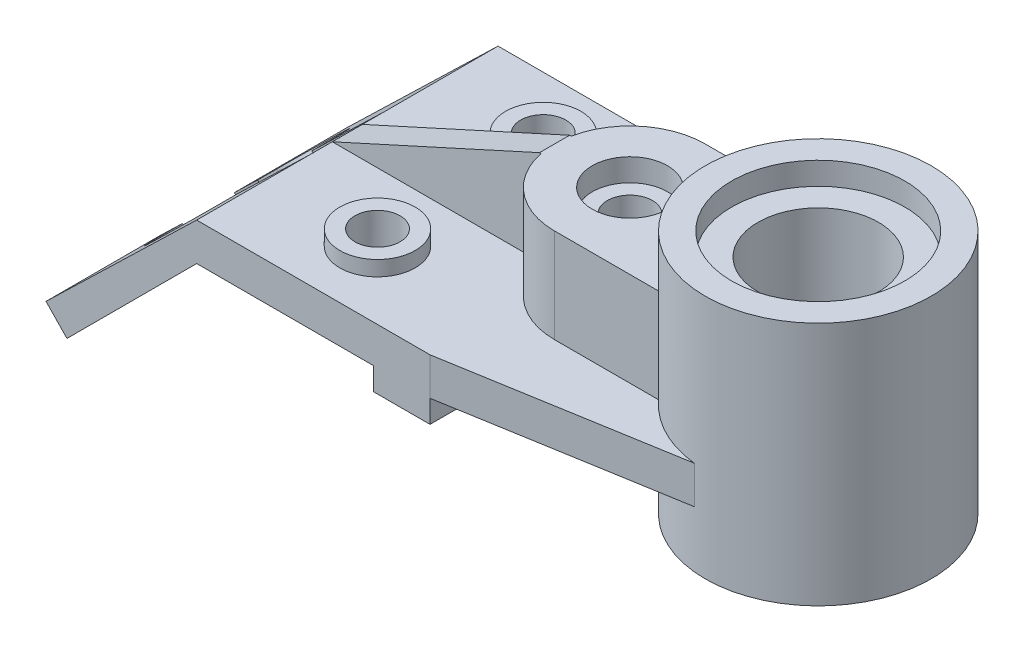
ISO-10303-21;
HEADER;
FILE_DESCRIPTION(('STEP AP214'),'2;1');
FILE_NAME('part.step','',(''),(''),'','','');
FILE_SCHEMA(('AUTOMOTIVE_DESIGN { 1 0 10303 214 1 1 1 1 }'));
ENDSEC;
DATA;
#1=APPLICATION_CONTEXT('core data for automotive mechanical design processes');
#2=APPLICATION_PROTOCOL_DEFINITION('international standard','automotive_design',2000,#1);
#3=PRODUCT_CONTEXT('',#1,'mechanical');
#4=PRODUCT('Part','Part','',(#3));
#5=PRODUCT_RELATED_PRODUCT_CATEGORY('part','',(#4));
#6=PRODUCT_DEFINITION_FORMATION('','',#4);
#7=PRODUCT_DEFINITION_CONTEXT('part definition',#1,'design');
#8=PRODUCT_DEFINITION('design','',#6,#7);
#9=PRODUCT_DEFINITION_SHAPE('','',#8);
#10=(LENGTH_UNIT() NAMED_UNIT(*) SI_UNIT(.MILLI.,.METRE.));
#11=(NAMED_UNIT(*) PLANE_ANGLE_UNIT() SI_UNIT($,.RADIAN.));
#12=(NAMED_UNIT(*) SI_UNIT($,.STERADIAN.) SOLID_ANGLE_UNIT());
#13=UNCERTAINTY_MEASURE_WITH_UNIT(LENGTH_MEASURE(1.E-05),#10,'distance_accuracy_value','');
#14=(GEOMETRIC_REPRESENTATION_CONTEXT(3) GLOBAL_UNCERTAINTY_ASSIGNED_CONTEXT((#13)) GLOBAL_UNIT_ASSIGNED_CONTEXT((#10,
#11,#12)) REPRESENTATION_CONTEXT('',''));
#15=CARTESIAN_POINT('',(0.,0.,0.));
#16=DIRECTION('',(0.,0.,1.));
#17=DIRECTION('',(1.,0.,0.));
#18=AXIS2_PLACEMENT_3D('',#15,#16,#17);
#19=CARTESIAN_POINT('',(-8.51996401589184,15.,-5.29140855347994));
#20=DIRECTION('',(0.,-1.,0.));
#21=DIRECTION('',(0.,0.,-1.));
#22=AXIS2_PLACEMENT_3D('',#19,#20,#21);
#23=PLANE('',#22);
#24=DIRECTION('',(0.,0.,1.));
#25=VECTOR('',#24,1.);
#26=CARTESIAN_POINT('',(-71.5732580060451,15.,-45.2914085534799));
#27=LINE('',#26,#25);
#28=CARTESIAN_POINT('',(-71.5732580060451,15.,-45.2914085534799));
#29=VERTEX_POINT('',#28);
#30=CARTESIAN_POINT('',(-71.5732580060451,15.,34.7085914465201));
#31=VERTEX_POINT('',#30);
#32=EDGE_CURVE('E432',#29,#31,#27,.T.);
#33=ORIENTED_EDGE('',*,*,#32,.F.);
#34=DIRECTION('',(-0.98597565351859,0.,-0.166889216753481));
#35=VECTOR('',#34,1.);
#36=CARTESIAN_POINT('',(-11.5732580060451,15.,-35.1356273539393));
#37=LINE('',#36,#35);
#38=CARTESIAN_POINT('',(-11.5732580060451,15.,-35.1356273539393));
#39=VERTEX_POINT('',#38);
#40=EDGE_CURVE('E280',#39,#29,#37,.T.);
#41=ORIENTED_EDGE('',*,*,#40,.F.);
#42=CARTESIAN_POINT('',(-8.51996401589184,15.,-5.29140855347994));
#43=DIRECTION('',(0.,-1.,0.));
#44=DIRECTION('',(0.,0.,-1.));
#45=AXIS2_PLACEMENT_3D('',#42,#43,#44);
#46=CIRCLE('',#45,30.);
#47=CARTESIAN_POINT('',(-11.5732580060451,15.,24.5528102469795));
#48=VERTEX_POINT('',#47);
#49=EDGE_CURVE('E288',#48,#39,#46,.T.);
#50=ORIENTED_EDGE('',*,*,#49,.F.);
#51=DIRECTION('',(0.985975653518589,0.,-0.166889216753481));
#52=VECTOR('',#51,1.);
#53=CARTESIAN_POINT('',(-71.5732580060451,15.,34.7085914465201));
#54=LINE('',#53,#52);
#55=EDGE_CURVE('E294',#31,#48,#54,.T.);
#56=ORIENTED_EDGE('',*,*,#55,.F.);
#57=EDGE_LOOP('',(#33,#41,#50,#56));
#58=FACE_BOUND('',#57,.T.);
#59=CARTESIAN_POINT('',(-58.5199640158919,15.,-5.29140855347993));
#60=DIRECTION('',(0.,-1.,0.));
#61=DIRECTION('',(0.,0.,-1.));
#62=AXIS2_PLACEMENT_3D('',#59,#60,#61);
#63=CIRCLE('',#62,6.);
#64=CARTESIAN_POINT('',(-58.5199640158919,15.,-11.2914085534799));
#65=VERTEX_POINT('',#64);
#66=EDGE_CURVE('E341',#65,#65,#63,.T.);
#67=ORIENTED_EDGE('',*,*,#66,.F.);
#68=EDGE_LOOP('',(#67));
#69=FACE_BOUND('',#68,.T.);
#70=ADVANCED_FACE('F43',(#58,#69),#23,.T.);
#71=CARTESIAN_POINT('',(-8.51996401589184,25.,-5.29140855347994));
#72=DIRECTION('',(0.,-1.,0.));
#73=DIRECTION('',(0.,0.,-1.));
#74=AXIS2_PLACEMENT_3D('',#71,#72,#73);
#75=PLANE('',#74);
#76=CARTESIAN_POINT('',(-103.519964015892,25.,-27.2914085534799));
#77=DIRECTION('',(0.,-1.,0.));
#78=DIRECTION('',(0.,0.,-1.));
#79=AXIS2_PLACEMENT_3D('',#76,#77,#78);
#80=CIRCLE('',#79,9.99999999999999);
#81=CARTESIAN_POINT('',(-103.519964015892,25.,-37.2914085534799));
#82=VERTEX_POINT('',#81);
#83=EDGE_CURVE('E340',#82,#82,#80,.F.);
#84=ORIENTED_EDGE('',*,*,#83,.F.);
#85=EDGE_LOOP('',(#84));
#86=FACE_BOUND('',#85,.T.);
#87=DIRECTION('',(1.,0.,0.));
#88=VECTOR('',#87,1.);
#89=CARTESIAN_POINT('',(-68.5199640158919,25.,-9.29140855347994));
#90=LINE('',#89,#88);
#91=CARTESIAN_POINT('',(-133.519964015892,25.,-9.29140855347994));
#92=VERTEX_POINT('',#91);
#93=CARTESIAN_POINT('',(-78.1158819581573,25.,-9.29140855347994));
#94=VERTEX_POINT('',#93);
#95=EDGE_CURVE('E355',#92,#94,#90,.T.);
#96=ORIENTED_EDGE('',*,*,#95,.T.);
#97=CARTESIAN_POINT('',(-58.5199640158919,25.,-5.29140855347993));
#98=DIRECTION('',(0.,1.,0.));
#99=DIRECTION('',(0.,0.,1.));
#100=AXIS2_PLACEMENT_3D('',#97,#98,#99);
#101=CIRCLE('',#100,20.);
#102=CARTESIAN_POINT('',(-58.5199640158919,25.,-25.2914085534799));
#103=VERTEX_POINT('',#102);
#104=EDGE_CURVE('E598',#103,#94,#101,.T.);
#105=ORIENTED_EDGE('',*,*,#104,.F.);
#106=DIRECTION('',(-1.,0.,0.));
#107=VECTOR('',#106,1.);
#108=CARTESIAN_POINT('',(-58.5199640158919,25.,-25.2914085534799));
#109=LINE('',#108,#107);
#110=CARTESIAN_POINT('',(-30.8806437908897,25.,-25.2914085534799));
#111=VERTEX_POINT('',#110);
#112=EDGE_CURVE('E606',#111,#103,#109,.T.);
#113=ORIENTED_EDGE('',*,*,#112,.F.);
#114=CARTESIAN_POINT('',(-8.51996401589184,25.,-5.29140855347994));
#115=DIRECTION('',(0.,-1.,0.));
#116=DIRECTION('',(0.,0.,-1.));
#117=AXIS2_PLACEMENT_3D('',#114,#115,#116);
#118=CIRCLE('',#117,30.);
#119=CARTESIAN_POINT('',(-11.5732580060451,25.,-35.1356273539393));
#120=VERTEX_POINT('',#119);
#121=EDGE_CURVE('E297',#111,#120,#118,.T.);
#122=ORIENTED_EDGE('',*,*,#121,.T.);
#123=DIRECTION('',(-0.98597565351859,0.,-0.166889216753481));
#124=VECTOR('',#123,1.);
#125=CARTESIAN_POINT('',(-11.5732580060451,25.,-35.1356273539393));
#126=LINE('',#125,#124);
#127=CARTESIAN_POINT('',(-71.5732580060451,25.,-45.2914085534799));
#128=VERTEX_POINT('',#127);
#129=EDGE_CURVE('E627',#120,#128,#126,.T.);
#130=ORIENTED_EDGE('',*,*,#129,.T.);
#131=DIRECTION('',(-1.,0.,0.));
#132=VECTOR('',#131,1.);
#133=CARTESIAN_POINT('',(-71.5732580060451,25.,-45.2914085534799));
#134=LINE('',#133,#132);
#135=CARTESIAN_POINT('',(-133.519964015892,25.,-45.2914085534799));
#136=VERTEX_POINT('',#135);
#137=EDGE_CURVE('E387',#128,#136,#134,.T.);
#138=ORIENTED_EDGE('',*,*,#137,.T.);
#139=DIRECTION('',(0.,0.,1.));
#140=VECTOR('',#139,1.);
#141=CARTESIAN_POINT('',(-133.519964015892,25.,-45.2914085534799));
#142=LINE('',#141,#140);
#143=EDGE_CURVE('E376',#136,#92,#142,.T.);
#144=ORIENTED_EDGE('',*,*,#143,.T.);
#145=EDGE_LOOP('',(#96,#105,#113,#122,#130,#138,#144));
#146=FACE_BOUND('',#145,.T.);
#147=ADVANCED_FACE('F637',(#86,#146),#75,.F.);
#148=CARTESIAN_POINT('',(-58.5199640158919,50.,-5.29140855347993));
#149=DIRECTION('',(0.,-1.,0.));
#150=DIRECTION('',(0.,0.,-1.));
#151=AXIS2_PLACEMENT_3D('',#148,#149,#150);
#152=CYLINDRICAL_SURFACE('',#151,20.);
#153=DIRECTION('',(0.,-1.,0.));
#154=VECTOR('',#153,1.);
#155=CARTESIAN_POINT('',(-78.1158819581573,50.,-9.29140855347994));
#156=LINE('',#155,#154);
#157=CARTESIAN_POINT('',(-78.1158819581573,50.,-9.29140855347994));
#158=VERTEX_POINT('',#157);
#159=EDGE_CURVE('E547',#158,#94,#156,.T.);
#160=ORIENTED_EDGE('',*,*,#159,.F.);
#161=CARTESIAN_POINT('',(-58.5199640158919,50.,-5.29140855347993));
#162=DIRECTION('',(0.,1.,0.));
#163=DIRECTION('',(0.,0.,1.));
#164=AXIS2_PLACEMENT_3D('',#161,#162,#163);
#165=CIRCLE('',#164,20.);
#166=CARTESIAN_POINT('',(-58.5199640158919,50.,-25.2914085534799));
#167=VERTEX_POINT('',#166);
#168=EDGE_CURVE('E585',#167,#158,#165,.T.);
#169=ORIENTED_EDGE('',*,*,#168,.F.);
#170=DIRECTION('',(0.,-1.,0.));
#171=VECTOR('',#170,1.);
#172=CARTESIAN_POINT('',(-58.5199640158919,50.,-25.2914085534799));
#173=LINE('',#172,#171);
#174=EDGE_CURVE('E597',#167,#103,#173,.T.);
#175=ORIENTED_EDGE('',*,*,#174,.T.);
#176=ORIENTED_EDGE('',*,*,#104,.T.);
#177=EDGE_LOOP('',(#160,#169,#175,#176));
#178=FACE_BOUND('',#177,.T.);
#179=ADVANCED_FACE('F792',(#178),#152,.T.);
#180=CARTESIAN_POINT('',(-8.51996401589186,65.,-5.29140855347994));
#181=DIRECTION('',(0.,-1.,0.));
#182=DIRECTION('',(0.,0.,-1.));
#183=AXIS2_PLACEMENT_3D('',#180,#181,#182);
#184=CYLINDRICAL_SURFACE('',#183,30.);
#185=CARTESIAN_POINT('',(-8.51996401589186,65.,-5.29140855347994));
#186=DIRECTION('',(0.,1.,0.));
#187=DIRECTION('',(0.,0.,1.));
#188=AXIS2_PLACEMENT_3D('',#185,#186,#187);
#189=CIRCLE('',#188,30.);
#190=CARTESIAN_POINT('',(-8.51996401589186,65.,24.7085914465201));
#191=VERTEX_POINT('',#190);
#192=EDGE_CURVE('E327',#191,#191,#189,.T.);
#193=ORIENTED_EDGE('',*,*,#192,.F.);
#194=EDGE_LOOP('',(#193));
#195=FACE_BOUND('',#194,.T.);
#196=CARTESIAN_POINT('',(-8.51996401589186,0.,-5.29140855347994));
#197=DIRECTION('',(0.,1.,0.));
#198=DIRECTION('',(0.,0.,1.));
#199=AXIS2_PLACEMENT_3D('',#196,#197,#198);
#200=CIRCLE('',#199,30.);
#201=CARTESIAN_POINT('',(-8.51996401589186,0.,24.7085914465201));
#202=VERTEX_POINT('',#201);
#203=EDGE_CURVE('E322',#202,#202,#200,.T.);
#204=ORIENTED_EDGE('',*,*,#203,.T.);
#205=EDGE_LOOP('',(#204));
#206=FACE_BOUND('',#205,.T.);
#207=DIRECTION('',(0.,-1.,0.));
#208=VECTOR('',#207,1.);
#209=CARTESIAN_POINT('',(-30.8806437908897,50.,14.7085914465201));
#210=LINE('',#209,#208);
#211=CARTESIAN_POINT('',(-30.8806437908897,50.,14.7085914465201));
#212=VERTEX_POINT('',#211);
#213=CARTESIAN_POINT('',(-30.8806437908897,25.,14.7085914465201));
#214=VERTEX_POINT('',#213);
#215=EDGE_CURVE('E617',#212,#214,#210,.T.);
#216=ORIENTED_EDGE('',*,*,#215,.T.);
#217=CARTESIAN_POINT('',(-11.5732580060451,25.,24.5528102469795));
#218=VERTEX_POINT('',#217);
#219=EDGE_CURVE('E624',#218,#214,#118,.T.);
#220=ORIENTED_EDGE('',*,*,#219,.F.);
#221=DIRECTION('',(0.,-1.,0.));
#222=VECTOR('',#221,1.);
#223=CARTESIAN_POINT('',(-11.5732580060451,25.,24.5528102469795));
#224=LINE('',#223,#222);
#225=EDGE_CURVE('E298',#218,#48,#224,.T.);
#226=ORIENTED_EDGE('',*,*,#225,.T.);
#227=ORIENTED_EDGE('',*,*,#49,.T.);
#228=DIRECTION('',(0.,-1.,0.));
#229=VECTOR('',#228,1.);
#230=CARTESIAN_POINT('',(-11.5732580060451,25.,-35.1356273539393));
#231=LINE('',#230,#229);
#232=EDGE_CURVE('E310',#120,#39,#231,.T.);
#233=ORIENTED_EDGE('',*,*,#232,.F.);
#234=ORIENTED_EDGE('',*,*,#121,.F.);
#235=DIRECTION('',(0.,-1.,0.));
#236=VECTOR('',#235,1.);
#237=CARTESIAN_POINT('',(-30.8806437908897,50.,-25.2914085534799));
#238=LINE('',#237,#236);
#239=CARTESIAN_POINT('',(-30.8806437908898,50.,-25.2914085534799));
#240=VERTEX_POINT('',#239);
#241=EDGE_CURVE('E613',#240,#111,#238,.T.);
#242=ORIENTED_EDGE('',*,*,#241,.F.);
#243=CARTESIAN_POINT('',(-8.51996401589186,50.,-5.29140855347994));
#244=DIRECTION('',(0.,1.,0.));
#245=DIRECTION('',(0.,0.,1.));
#246=AXIS2_PLACEMENT_3D('',#243,#244,#245);
#247=CIRCLE('',#246,30.);
#248=EDGE_CURVE('E331',#240,#212,#247,.T.);
#249=ORIENTED_EDGE('',*,*,#248,.T.);
#250=EDGE_LOOP('',(#216,#220,#226,#227,#233,#234,#242,#249));
#251=FACE_BOUND('',#250,.T.);
#252=ADVANCED_FACE('F45',(#195,#206,#251),#184,.T.);
#253=CARTESIAN_POINT('',(-103.519964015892,25.,16.7085914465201));
#254=DIRECTION('',(0.,-1.,0.));
#255=DIRECTION('',(0.,0.,-1.));
#256=AXIS2_PLACEMENT_3D('',#253,#254,#255);
#257=CIRCLE('',#256,9.99999999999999);
#258=CARTESIAN_POINT('',(-103.519964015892,25.,6.70859144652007));
#259=VERTEX_POINT('',#258);
#260=EDGE_CURVE('E350',#259,#259,#257,.F.);
#261=ORIENTED_EDGE('',*,*,#260,.F.);
#262=EDGE_LOOP('',(#261));
#263=FACE_BOUND('',#262,.T.);
#264=CARTESIAN_POINT('',(-78.1158819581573,25.,-1.29140855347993));
#265=VERTEX_POINT('',#264);
#266=CARTESIAN_POINT('',(-58.5199640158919,25.,14.7085914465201));
#267=VERTEX_POINT('',#266);
#268=EDGE_CURVE('E581',#265,#267,#101,.T.);
#269=ORIENTED_EDGE('',*,*,#268,.F.);
#270=DIRECTION('',(1.,0.,0.));
#271=VECTOR('',#270,1.);
#272=CARTESIAN_POINT('',(-68.5199640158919,25.,-1.29140855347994));
#273=LINE('',#272,#271);
#274=CARTESIAN_POINT('',(-133.519964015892,25.,-1.29140855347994));
#275=VERTEX_POINT('',#274);
#276=EDGE_CURVE('E533',#275,#265,#273,.T.);
#277=ORIENTED_EDGE('',*,*,#276,.F.);
#278=CARTESIAN_POINT('',(-133.519964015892,25.,34.7085914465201));
#279=VERTEX_POINT('',#278);
#280=EDGE_CURVE('E382',#275,#279,#142,.T.);
#281=ORIENTED_EDGE('',*,*,#280,.T.);
#282=DIRECTION('',(1.,0.,0.));
#283=VECTOR('',#282,1.);
#284=CARTESIAN_POINT('',(-133.519964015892,25.,34.7085914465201));
#285=LINE('',#284,#283);
#286=CARTESIAN_POINT('',(-71.5732580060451,25.,34.7085914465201));
#287=VERTEX_POINT('',#286);
#288=EDGE_CURVE('E381',#279,#287,#285,.T.);
#289=ORIENTED_EDGE('',*,*,#288,.T.);
#290=DIRECTION('',(0.985975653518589,0.,-0.166889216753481));
#291=VECTOR('',#290,1.);
#292=CARTESIAN_POINT('',(-71.5732580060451,25.,34.7085914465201));
#293=LINE('',#292,#291);
#294=EDGE_CURVE('E303',#287,#218,#293,.T.);
#295=ORIENTED_EDGE('',*,*,#294,.T.);
#296=ORIENTED_EDGE('',*,*,#219,.T.);
#297=DIRECTION('',(1.,0.,0.));
#298=VECTOR('',#297,1.);
#299=CARTESIAN_POINT('',(-58.5199640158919,25.,14.7085914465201));
#300=LINE('',#299,#298);
#301=EDGE_CURVE('E602',#267,#214,#300,.T.);
#302=ORIENTED_EDGE('',*,*,#301,.F.);
#303=EDGE_LOOP('',(#269,#277,#281,#289,#295,#296,#302));
#304=FACE_BOUND('',#303,.T.);
#305=ADVANCED_FACE('F747',(#263,#304),#75,.F.);
#306=CARTESIAN_POINT('',(-8.51996401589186,65.,-5.29140855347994));
#307=DIRECTION('',(0.,1.,0.));
#308=DIRECTION('',(0.,0.,1.));
#309=AXIS2_PLACEMENT_3D('',#306,#307,#308);
#310=PLANE('',#309);
#311=CARTESIAN_POINT('',(-8.51996401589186,65.,-5.29140855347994));
#312=DIRECTION('',(0.,1.,0.));
#313=DIRECTION('',(0.,0.,1.));
#314=AXIS2_PLACEMENT_3D('',#311,#312,#313);
#315=CIRCLE('',#314,23.);
#316=CARTESIAN_POINT('',(-8.51996401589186,65.,17.7085914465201));
#317=VERTEX_POINT('',#316);
#318=EDGE_CURVE('E323',#317,#317,#315,.T.);
#319=ORIENTED_EDGE('',*,*,#318,.F.);
#320=EDGE_LOOP('',(#319));
#321=FACE_BOUND('',#320,.T.);
#322=ORIENTED_EDGE('',*,*,#192,.T.);
#323=EDGE_LOOP('',(#322));
#324=FACE_BOUND('',#323,.T.);
#325=ADVANCED_FACE('F828',(#321,#324),#310,.T.);
#326=CARTESIAN_POINT('',(-8.51996401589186,0.,-5.29140855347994));
#327=DIRECTION('',(0.,1.,0.));
#328=DIRECTION('',(0.,0.,1.));
#329=AXIS2_PLACEMENT_3D('',#326,#327,#328);
#330=PLANE('',#329);
#331=CARTESIAN_POINT('',(-8.51996401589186,0.,-5.29140855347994));
#332=DIRECTION('',(0.,1.,0.));
#333=DIRECTION('',(0.,0.,1.));
#334=AXIS2_PLACEMENT_3D('',#331,#332,#333);
#335=CIRCLE('',#334,16.);
#336=CARTESIAN_POINT('',(-8.51996401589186,0.,10.7085914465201));
#337=VERTEX_POINT('',#336);
#338=EDGE_CURVE('E317',#337,#337,#335,.T.);
#339=ORIENTED_EDGE('',*,*,#338,.T.);
#340=EDGE_LOOP('',(#339));
#341=FACE_BOUND('',#340,.T.);
#342=ORIENTED_EDGE('',*,*,#203,.F.);
#343=EDGE_LOOP('',(#342));
#344=FACE_BOUND('',#343,.T.);
#345=ADVANCED_FACE('F826',(#341,#344),#330,.F.);
#346=CARTESIAN_POINT('',(-8.51996401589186,59.,-5.29140855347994));
#347=DIRECTION('',(0.,1.,0.));
#348=DIRECTION('',(0.,0.,1.));
#349=AXIS2_PLACEMENT_3D('',#346,#347,#348);
#350=CYLINDRICAL_SURFACE('',#349,23.);
#351=CARTESIAN_POINT('',(-8.51996401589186,59.,-5.29140855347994));
#352=DIRECTION('',(0.,1.,0.));
#353=DIRECTION('',(0.,0.,1.));
#354=AXIS2_PLACEMENT_3D('',#351,#352,#353);
#355=CIRCLE('',#354,23.);
#356=CARTESIAN_POINT('',(-8.51996401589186,59.,17.7085914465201));
#357=VERTEX_POINT('',#356);
#358=EDGE_CURVE('E318',#357,#357,#355,.T.);
#359=ORIENTED_EDGE('',*,*,#358,.F.);
#360=EDGE_LOOP('',(#359));
#361=FACE_BOUND('',#360,.T.);
#362=ORIENTED_EDGE('',*,*,#318,.T.);
#363=EDGE_LOOP('',(#362));
#364=FACE_BOUND('',#363,.T.);
#365=ADVANCED_FACE('F822',(#361,#364),#350,.F.);
#366=CARTESIAN_POINT('',(-8.51996401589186,59.,-5.29140855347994));
#367=DIRECTION('',(0.,1.,0.));
#368=DIRECTION('',(0.,0.,1.));
#369=AXIS2_PLACEMENT_3D('',#366,#367,#368);
#370=PLANE('',#369);
#371=CARTESIAN_POINT('',(-8.51996401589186,59.,-5.29140855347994));
#372=DIRECTION('',(0.,1.,0.));
#373=DIRECTION('',(0.,0.,1.));
#374=AXIS2_PLACEMENT_3D('',#371,#372,#373);
#375=CIRCLE('',#374,16.);
#376=CARTESIAN_POINT('',(-8.51996401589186,59.,10.7085914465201));
#377=VERTEX_POINT('',#376);
#378=EDGE_CURVE('E313',#377,#377,#375,.T.);
#379=ORIENTED_EDGE('',*,*,#378,.F.);
#380=EDGE_LOOP('',(#379));
#381=FACE_BOUND('',#380,.T.);
#382=ORIENTED_EDGE('',*,*,#358,.T.);
#383=EDGE_LOOP('',(#382));
#384=FACE_BOUND('',#383,.T.);
#385=ADVANCED_FACE('F818',(#381,#384),#370,.T.);
#386=CARTESIAN_POINT('',(-8.51996401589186,-51.,-5.29140855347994));
#387=DIRECTION('',(0.,1.,0.));
#388=DIRECTION('',(0.,0.,1.));
#389=AXIS2_PLACEMENT_3D('',#386,#387,#388);
#390=CYLINDRICAL_SURFACE('',#389,16.);
#391=ORIENTED_EDGE('',*,*,#378,.T.);
#392=EDGE_LOOP('',(#391));
#393=FACE_BOUND('',#392,.T.);
#394=ORIENTED_EDGE('',*,*,#338,.F.);
#395=EDGE_LOOP('',(#394));
#396=FACE_BOUND('',#395,.T.);
#397=ADVANCED_FACE('F814',(#393,#396),#390,.F.);
#398=CARTESIAN_POINT('',(-11.5732580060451,25.,-35.1356273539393));
#399=DIRECTION('',(-0.166889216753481,0.,0.98597565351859));
#400=DIRECTION('',(0.98597565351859,0.,0.166889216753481));
#401=AXIS2_PLACEMENT_3D('',#398,#399,#400);
#402=PLANE('',#401);
#403=ORIENTED_EDGE('',*,*,#40,.T.);
#404=DIRECTION('',(0.,-1.,0.));
#405=VECTOR('',#404,1.);
#406=CARTESIAN_POINT('',(-71.5732580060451,25.,-45.2914085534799));
#407=LINE('',#406,#405);
#408=EDGE_CURVE('E307',#128,#29,#407,.T.);
#409=ORIENTED_EDGE('',*,*,#408,.F.);
#410=ORIENTED_EDGE('',*,*,#129,.F.);
#411=ORIENTED_EDGE('',*,*,#232,.T.);
#412=EDGE_LOOP('',(#403,#409,#410,#411));
#413=FACE_BOUND('',#412,.T.);
#414=ADVANCED_FACE('F811',(#413),#402,.F.);
#415=CARTESIAN_POINT('',(-71.5732580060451,25.,-45.2914085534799));
#416=DIRECTION('',(0.,0.,1.));
#417=DIRECTION('',(1.,0.,0.));
#418=AXIS2_PLACEMENT_3D('',#415,#416,#417);
#419=PLANE('',#418);
#420=ORIENTED_EDGE('',*,*,#408,.T.);
#421=DIRECTION('',(0.,1.,0.));
#422=VECTOR('',#421,1.);
#423=CARTESIAN_POINT('',(-71.5732580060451,15.,-45.2914085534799));
#424=LINE('',#423,#422);
#425=CARTESIAN_POINT('',(-71.5732580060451,9.,-45.2914085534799));
#426=VERTEX_POINT('',#425);
#427=EDGE_CURVE('E259',#426,#29,#424,.T.);
#428=ORIENTED_EDGE('',*,*,#427,.F.);
#429=DIRECTION('',(1.,0.,0.));
#430=VECTOR('',#429,1.);
#431=CARTESIAN_POINT('',(-71.5732580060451,9.,-45.2914085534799));
#432=LINE('',#431,#430);
#433=CARTESIAN_POINT('',(-86.5732580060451,9.,-45.2914085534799));
#434=VERTEX_POINT('',#433);
#435=EDGE_CURVE('E270',#434,#426,#432,.T.);
#436=ORIENTED_EDGE('',*,*,#435,.F.);
#437=DIRECTION('',(0.,-1.,0.));
#438=VECTOR('',#437,1.);
#439=CARTESIAN_POINT('',(-86.5732580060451,9.,-45.2914085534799));
#440=LINE('',#439,#438);
#441=CARTESIAN_POINT('',(-86.5732580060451,15.,-45.2914085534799));
#442=VERTEX_POINT('',#441);
#443=EDGE_CURVE('E251',#442,#434,#440,.T.);
#444=ORIENTED_EDGE('',*,*,#443,.F.);
#445=DIRECTION('',(-1.,0.,0.));
#446=VECTOR('',#445,1.);
#447=CARTESIAN_POINT('',(-71.5732580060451,15.,-45.2914085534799));
#448=LINE('',#447,#446);
#449=CARTESIAN_POINT('',(-133.519964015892,15.,-45.2914085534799));
#450=VERTEX_POINT('',#449);
#451=EDGE_CURVE('E266',#442,#450,#448,.T.);
#452=ORIENTED_EDGE('',*,*,#451,.T.);
#453=DIRECTION('',(0.707106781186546,0.707106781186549,0.));
#454=VECTOR('',#453,1.);
#455=CARTESIAN_POINT('',(-167.958212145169,-19.4382481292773,-45.2914085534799));
#456=LINE('',#455,#454);
#457=CARTESIAN_POINT('',(-167.958212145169,-19.4382481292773,-45.2914085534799));
#458=VERTEX_POINT('',#457);
#459=EDGE_CURVE('E516',#458,#450,#456,.T.);
#460=ORIENTED_EDGE('',*,*,#459,.F.);
#461=DIRECTION('',(0.695218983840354,-0.718797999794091,0.));
#462=VECTOR('',#461,1.);
#463=CARTESIAN_POINT('',(-173.519964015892,-13.6878641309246,-45.2914085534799));
#464=LINE('',#463,#462);
#465=CARTESIAN_POINT('',(-173.519964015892,-13.6878641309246,-45.2914085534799));
#466=VERTEX_POINT('',#465);
#467=EDGE_CURVE('E511',#466,#458,#464,.T.);
#468=ORIENTED_EDGE('',*,*,#467,.F.);
#469=DIRECTION('',(-0.718797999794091,-0.695218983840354,0.));
#470=VECTOR('',#469,1.);
#471=CARTESIAN_POINT('',(-133.519964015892,25.,-45.2914085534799));
#472=LINE('',#471,#470);
#473=EDGE_CURVE('E508',#136,#466,#472,.T.);
#474=ORIENTED_EDGE('',*,*,#473,.F.);
#475=ORIENTED_EDGE('',*,*,#137,.F.);
#476=EDGE_LOOP('',(#420,#428,#436,#444,#452,#460,#468,#474,#475));
#477=FACE_BOUND('',#476,.T.);
#478=ADVANCED_FACE('F264',(#477),#419,.F.);
#479=CARTESIAN_POINT('',(-133.519964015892,25.,34.7085914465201));
#480=DIRECTION('',(0.,0.,-1.));
#481=DIRECTION('',(-1.,0.,0.));
#482=AXIS2_PLACEMENT_3D('',#479,#480,#481);
#483=PLANE('',#482);
#484=DIRECTION('',(1.,0.,0.));
#485=VECTOR('',#484,1.);
#486=CARTESIAN_POINT('',(-133.519964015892,15.,34.7085914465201));
#487=LINE('',#486,#485);
#488=CARTESIAN_POINT('',(-133.519964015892,15.,34.7085914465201));
#489=VERTEX_POINT('',#488);
#490=CARTESIAN_POINT('',(-86.5732580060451,15.,34.7085914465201));
#491=VERTEX_POINT('',#490);
#492=EDGE_CURVE('E285',#489,#491,#487,.T.);
#493=ORIENTED_EDGE('',*,*,#492,.T.);
#494=DIRECTION('',(0.,-1.,0.));
#495=VECTOR('',#494,1.);
#496=CARTESIAN_POINT('',(-86.5732580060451,9.,34.7085914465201));
#497=LINE('',#496,#495);
#498=CARTESIAN_POINT('',(-86.5732580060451,9.,34.7085914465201));
#499=VERTEX_POINT('',#498);
#500=EDGE_CURVE('E253',#491,#499,#497,.T.);
#501=ORIENTED_EDGE('',*,*,#500,.T.);
#502=DIRECTION('',(1.,0.,0.));
#503=VECTOR('',#502,1.);
#504=CARTESIAN_POINT('',(-71.5732580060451,9.,34.7085914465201));
#505=LINE('',#504,#503);
#506=CARTESIAN_POINT('',(-71.5732580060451,9.,34.7085914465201));
#507=VERTEX_POINT('',#506);
#508=EDGE_CURVE('E954',#499,#507,#505,.T.);
#509=ORIENTED_EDGE('',*,*,#508,.T.);
#510=DIRECTION('',(0.,1.,0.));
#511=VECTOR('',#510,1.);
#512=CARTESIAN_POINT('',(-71.5732580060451,15.,34.7085914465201));
#513=LINE('',#512,#511);
#514=EDGE_CURVE('E272',#507,#31,#513,.T.);
#515=ORIENTED_EDGE('',*,*,#514,.T.);
#516=DIRECTION('',(0.,-1.,0.));
#517=VECTOR('',#516,1.);
#518=CARTESIAN_POINT('',(-71.5732580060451,25.,34.7085914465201));
#519=LINE('',#518,#517);
#520=EDGE_CURVE('E302',#287,#31,#519,.T.);
#521=ORIENTED_EDGE('',*,*,#520,.F.);
#522=ORIENTED_EDGE('',*,*,#288,.F.);
#523=DIRECTION('',(-0.718797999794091,-0.695218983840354,0.));
#524=VECTOR('',#523,1.);
#525=CARTESIAN_POINT('',(-133.519964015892,25.,34.7085914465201));
#526=LINE('',#525,#524);
#527=CARTESIAN_POINT('',(-173.519964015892,-13.6878641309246,34.7085914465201));
#528=VERTEX_POINT('',#527);
#529=EDGE_CURVE('E507',#279,#528,#526,.T.);
#530=ORIENTED_EDGE('',*,*,#529,.T.);
#531=DIRECTION('',(0.695218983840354,-0.718797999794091,0.));
#532=VECTOR('',#531,1.);
#533=CARTESIAN_POINT('',(-173.519964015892,-13.6878641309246,34.7085914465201));
#534=LINE('',#533,#532);
#535=CARTESIAN_POINT('',(-167.958212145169,-19.4382481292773,34.7085914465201));
#536=VERTEX_POINT('',#535);
#537=EDGE_CURVE('E523',#528,#536,#534,.T.);
#538=ORIENTED_EDGE('',*,*,#537,.T.);
#539=DIRECTION('',(0.707106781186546,0.707106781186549,0.));
#540=VECTOR('',#539,1.);
#541=CARTESIAN_POINT('',(-167.958212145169,-19.4382481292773,34.7085914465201));
#542=LINE('',#541,#540);
#543=EDGE_CURVE('E512',#536,#489,#542,.T.);
#544=ORIENTED_EDGE('',*,*,#543,.T.);
#545=EDGE_LOOP('',(#493,#501,#509,#515,#521,#522,#530,#538,#544));
#546=FACE_BOUND('',#545,.T.);
#547=ADVANCED_FACE('F751',(#546),#483,.F.);
#548=CARTESIAN_POINT('',(-71.5732580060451,25.,34.7085914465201));
#549=DIRECTION('',(-0.166889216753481,0.,-0.98597565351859));
#550=DIRECTION('',(-0.98597565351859,0.,0.166889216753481));
#551=AXIS2_PLACEMENT_3D('',#548,#549,#550);
#552=PLANE('',#551);
#553=ORIENTED_EDGE('',*,*,#55,.T.);
#554=ORIENTED_EDGE('',*,*,#225,.F.);
#555=ORIENTED_EDGE('',*,*,#294,.F.);
#556=ORIENTED_EDGE('',*,*,#520,.T.);
#557=EDGE_LOOP('',(#553,#554,#555,#556));
#558=FACE_BOUND('',#557,.T.);
#559=ADVANCED_FACE('F757',(#558),#552,.F.);
#560=DIRECTION('',(0.,0.,1.));
#561=VECTOR('',#560,1.);
#562=CARTESIAN_POINT('',(-86.5732580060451,15.,-45.2914085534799));
#563=LINE('',#562,#561);
#564=EDGE_CURVE('E248',#442,#491,#563,.T.);
#565=ORIENTED_EDGE('',*,*,#564,.T.);
#566=ORIENTED_EDGE('',*,*,#492,.F.);
#567=DIRECTION('',(0.,0.,1.));
#568=VECTOR('',#567,1.);
#569=CARTESIAN_POINT('',(-133.519964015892,15.,-45.2914085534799));
#570=LINE('',#569,#568);
#571=EDGE_CURVE('E277',#450,#489,#570,.T.);
#572=ORIENTED_EDGE('',*,*,#571,.F.);
#573=ORIENTED_EDGE('',*,*,#451,.F.);
#574=EDGE_LOOP('',(#565,#566,#572,#573));
#575=FACE_BOUND('',#574,.T.);
#576=CARTESIAN_POINT('',(-103.519964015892,15.,16.7085914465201));
#577=DIRECTION('',(0.,-1.,0.));
#578=DIRECTION('',(0.,0.,-1.));
#579=AXIS2_PLACEMENT_3D('',#576,#577,#578);
#580=CIRCLE('',#579,6.);
#581=CARTESIAN_POINT('',(-103.519964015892,15.,10.7085914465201));
#582=VERTEX_POINT('',#581);
#583=EDGE_CURVE('E554',#582,#582,#580,.T.);
#584=ORIENTED_EDGE('',*,*,#583,.F.);
#585=EDGE_LOOP('',(#584));
#586=FACE_BOUND('',#585,.T.);
#587=CARTESIAN_POINT('',(-103.519964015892,15.,-27.2914085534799));
#588=DIRECTION('',(0.,-1.,0.));
#589=DIRECTION('',(0.,0.,-1.));
#590=AXIS2_PLACEMENT_3D('',#587,#588,#589);
#591=CIRCLE('',#590,6.);
#592=CARTESIAN_POINT('',(-103.519964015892,15.,-33.2914085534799));
#593=VERTEX_POINT('',#592);
#594=EDGE_CURVE('E562',#593,#593,#591,.T.);
#595=ORIENTED_EDGE('',*,*,#594,.F.);
#596=EDGE_LOOP('',(#595));
#597=FACE_BOUND('',#596,.T.);
#598=ADVANCED_FACE('F274',(#575,#586,#597),#23,.T.);
#599=CARTESIAN_POINT('',(-78.1158819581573,50.,-1.29140855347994));
#600=VERTEX_POINT('',#599);
#601=CARTESIAN_POINT('',(-58.5199640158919,50.,14.7085914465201));
#602=VERTEX_POINT('',#601);
#603=EDGE_CURVE('E590',#600,#602,#165,.T.);
#604=ORIENTED_EDGE('',*,*,#603,.F.);
#605=DIRECTION('',(0.,-1.,0.));
#606=VECTOR('',#605,1.);
#607=CARTESIAN_POINT('',(-78.1158819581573,50.,-1.29140855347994));
#608=LINE('',#607,#606);
#609=EDGE_CURVE('E373',#600,#265,#608,.T.);
#610=ORIENTED_EDGE('',*,*,#609,.T.);
#611=ORIENTED_EDGE('',*,*,#268,.T.);
#612=DIRECTION('',(0.,-1.,0.));
#613=VECTOR('',#612,1.);
#614=CARTESIAN_POINT('',(-58.5199640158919,50.,14.7085914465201));
#615=LINE('',#614,#613);
#616=EDGE_CURVE('E620',#602,#267,#615,.T.);
#617=ORIENTED_EDGE('',*,*,#616,.F.);
#618=EDGE_LOOP('',(#604,#610,#611,#617));
#619=FACE_BOUND('',#618,.T.);
#620=ADVANCED_FACE('F767',(#619),#152,.T.);
#621=CARTESIAN_POINT('',(-58.5199640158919,50.,14.7085914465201));
#622=DIRECTION('',(0.,0.,-1.));
#623=DIRECTION('',(-1.,0.,0.));
#624=AXIS2_PLACEMENT_3D('',#621,#622,#623);
#625=PLANE('',#624);
#626=ORIENTED_EDGE('',*,*,#301,.T.);
#627=ORIENTED_EDGE('',*,*,#215,.F.);
#628=DIRECTION('',(1.,0.,0.));
#629=VECTOR('',#628,1.);
#630=CARTESIAN_POINT('',(-58.5199640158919,50.,14.7085914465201));
#631=LINE('',#630,#629);
#632=EDGE_CURVE('E589',#602,#212,#631,.T.);
#633=ORIENTED_EDGE('',*,*,#632,.F.);
#634=ORIENTED_EDGE('',*,*,#616,.T.);
#635=EDGE_LOOP('',(#626,#627,#633,#634));
#636=FACE_BOUND('',#635,.T.);
#637=ADVANCED_FACE('F762',(#636),#625,.F.);
#638=CARTESIAN_POINT('',(-58.5199640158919,50.,-25.2914085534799));
#639=DIRECTION('',(0.,0.,1.));
#640=DIRECTION('',(1.,0.,0.));
#641=AXIS2_PLACEMENT_3D('',#638,#639,#640);
#642=PLANE('',#641);
#643=ORIENTED_EDGE('',*,*,#112,.T.);
#644=ORIENTED_EDGE('',*,*,#174,.F.);
#645=DIRECTION('',(-1.,0.,0.));
#646=VECTOR('',#645,1.);
#647=CARTESIAN_POINT('',(-58.5199640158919,50.,-25.2914085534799));
#648=LINE('',#647,#646);
#649=EDGE_CURVE('E594',#240,#167,#648,.T.);
#650=ORIENTED_EDGE('',*,*,#649,.F.);
#651=ORIENTED_EDGE('',*,*,#241,.T.);
#652=EDGE_LOOP('',(#643,#644,#650,#651));
#653=FACE_BOUND('',#652,.T.);
#654=ADVANCED_FACE('F855',(#653),#642,.F.);
#655=CARTESIAN_POINT('',(-58.5199640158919,50.,-5.29140855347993));
#656=DIRECTION('',(0.,1.,0.));
#657=DIRECTION('',(0.,0.,1.));
#658=AXIS2_PLACEMENT_3D('',#655,#656,#657);
#659=PLANE('',#658);
#660=CARTESIAN_POINT('',(-58.5199640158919,50.,-5.29140855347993));
#661=DIRECTION('',(0.,1.,0.));
#662=DIRECTION('',(0.,0.,1.));
#663=AXIS2_PLACEMENT_3D('',#660,#661,#662);
#664=CIRCLE('',#663,9.99999999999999);
#665=CARTESIAN_POINT('',(-58.5199640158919,50.,4.70859144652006));
#666=VERTEX_POINT('',#665);
#667=EDGE_CURVE('E345',#666,#666,#664,.T.);
#668=ORIENTED_EDGE('',*,*,#667,.F.);
#669=EDGE_LOOP('',(#668));
#670=FACE_BOUND('',#669,.T.);
#671=ORIENTED_EDGE('',*,*,#168,.T.);
#672=DIRECTION('',(-1.,0.,0.));
#673=VECTOR('',#672,1.);
#674=CARTESIAN_POINT('',(-78.5199640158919,50.,-9.29140855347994));
#675=LINE('',#674,#673);
#676=CARTESIAN_POINT('',(-78.5199640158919,50.,-9.29140855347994));
#677=VERTEX_POINT('',#676);
#678=EDGE_CURVE('E359',#158,#677,#675,.T.);
#679=ORIENTED_EDGE('',*,*,#678,.T.);
#680=DIRECTION('',(0.,0.,1.));
#681=VECTOR('',#680,1.);
#682=CARTESIAN_POINT('',(-78.5199640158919,50.,-9.29140855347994));
#683=LINE('',#682,#681);
#684=CARTESIAN_POINT('',(-78.5199640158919,50.,-1.29140855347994));
#685=VERTEX_POINT('',#684);
#686=EDGE_CURVE('E367',#677,#685,#683,.T.);
#687=ORIENTED_EDGE('',*,*,#686,.T.);
#688=DIRECTION('',(-1.,0.,0.));
#689=VECTOR('',#688,1.);
#690=CARTESIAN_POINT('',(-78.5199640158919,50.,-1.29140855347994));
#691=LINE('',#690,#689);
#692=EDGE_CURVE('E536',#600,#685,#691,.T.);
#693=ORIENTED_EDGE('',*,*,#692,.F.);
#694=ORIENTED_EDGE('',*,*,#603,.T.);
#695=ORIENTED_EDGE('',*,*,#632,.T.);
#696=ORIENTED_EDGE('',*,*,#248,.F.);
#697=ORIENTED_EDGE('',*,*,#649,.T.);
#698=EDGE_LOOP('',(#671,#679,#687,#693,#694,#695,#696,#697));
#699=FACE_BOUND('',#698,.T.);
#700=ADVANCED_FACE('F858',(#670,#699),#659,.T.);
#701=CARTESIAN_POINT('',(-58.5199640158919,44.,-5.29140855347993));
#702=DIRECTION('',(0.,1.,0.));
#703=DIRECTION('',(0.,0.,1.));
#704=AXIS2_PLACEMENT_3D('',#701,#702,#703);
#705=CYLINDRICAL_SURFACE('',#704,9.99999999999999);
#706=CARTESIAN_POINT('',(-58.5199640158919,44.,-5.29140855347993));
#707=DIRECTION('',(0.,1.,0.));
#708=DIRECTION('',(0.,0.,1.));
#709=AXIS2_PLACEMENT_3D('',#706,#707,#708);
#710=CIRCLE('',#709,9.99999999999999);
#711=CARTESIAN_POINT('',(-58.5199640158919,44.,4.70859144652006));
#712=VERTEX_POINT('',#711);
#713=EDGE_CURVE('E577',#712,#712,#710,.T.);
#714=ORIENTED_EDGE('',*,*,#713,.F.);
#715=EDGE_LOOP('',(#714));
#716=FACE_BOUND('',#715,.T.);
#717=ORIENTED_EDGE('',*,*,#667,.T.);
#718=EDGE_LOOP('',(#717));
#719=FACE_BOUND('',#718,.T.);
#720=ADVANCED_FACE('F862',(#716,#719),#705,.F.);
#721=CARTESIAN_POINT('',(-58.5199640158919,44.,-5.29140855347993));
#722=DIRECTION('',(0.,1.,0.));
#723=DIRECTION('',(0.,0.,1.));
#724=AXIS2_PLACEMENT_3D('',#721,#722,#723);
#725=PLANE('',#724);
#726=CARTESIAN_POINT('',(-58.5199640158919,44.,-5.29140855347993));
#727=DIRECTION('',(0.,1.,0.));
#728=DIRECTION('',(0.,0.,1.));
#729=AXIS2_PLACEMENT_3D('',#726,#727,#728);
#730=CIRCLE('',#729,6.);
#731=CARTESIAN_POINT('',(-58.5199640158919,44.,0.708591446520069));
#732=VERTEX_POINT('',#731);
#733=EDGE_CURVE('E346',#732,#732,#730,.T.);
#734=ORIENTED_EDGE('',*,*,#733,.F.);
#735=EDGE_LOOP('',(#734));
#736=FACE_BOUND('',#735,.T.);
#737=ORIENTED_EDGE('',*,*,#713,.T.);
#738=EDGE_LOOP('',(#737));
#739=FACE_BOUND('',#738,.T.);
#740=ADVANCED_FACE('F866',(#736,#739),#725,.T.);
#741=CARTESIAN_POINT('',(-58.5199640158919,9.,-5.29140855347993));
#742=DIRECTION('',(0.,1.,0.));
#743=DIRECTION('',(0.,0.,1.));
#744=AXIS2_PLACEMENT_3D('',#741,#742,#743);
#745=CYLINDRICAL_SURFACE('',#744,6.);
#746=ORIENTED_EDGE('',*,*,#66,.T.);
#747=EDGE_LOOP('',(#746));
#748=FACE_BOUND('',#747,.T.);
#749=ORIENTED_EDGE('',*,*,#733,.T.);
#750=EDGE_LOOP('',(#749));
#751=FACE_BOUND('',#750,.T.);
#752=ADVANCED_FACE('F870',(#748,#751),#745,.F.);
#753=CARTESIAN_POINT('',(-103.519964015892,29.,-27.2914085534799));
#754=DIRECTION('',(0.,-1.,0.));
#755=DIRECTION('',(0.,0.,-1.));
#756=AXIS2_PLACEMENT_3D('',#753,#754,#755);
#757=CYLINDRICAL_SURFACE('',#756,9.99999999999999);
#758=CARTESIAN_POINT('',(-103.519964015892,29.,-27.2914085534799));
#759=DIRECTION('',(0.,1.,0.));
#760=DIRECTION('',(0.,0.,1.));
#761=AXIS2_PLACEMENT_3D('',#758,#759,#760);
#762=CIRCLE('',#761,9.99999999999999);
#763=CARTESIAN_POINT('',(-103.519964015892,29.,-17.2914085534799));
#764=VERTEX_POINT('',#763);
#765=EDGE_CURVE('E570',#764,#764,#762,.T.);
#766=ORIENTED_EDGE('',*,*,#765,.F.);
#767=EDGE_LOOP('',(#766));
#768=FACE_BOUND('',#767,.T.);
#769=ORIENTED_EDGE('',*,*,#83,.T.);
#770=EDGE_LOOP('',(#769));
#771=FACE_BOUND('',#770,.T.);
#772=ADVANCED_FACE('F874',(#768,#771),#757,.T.);
#773=CARTESIAN_POINT('',(-103.519964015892,29.,-27.2914085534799));
#774=DIRECTION('',(0.,1.,0.));
#775=DIRECTION('',(0.,0.,1.));
#776=AXIS2_PLACEMENT_3D('',#773,#774,#775);
#777=PLANE('',#776);
#778=CARTESIAN_POINT('',(-103.519964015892,29.,-27.2914085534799));
#779=DIRECTION('',(0.,1.,0.));
#780=DIRECTION('',(0.,0.,1.));
#781=AXIS2_PLACEMENT_3D('',#778,#779,#780);
#782=CIRCLE('',#781,6.);
#783=CARTESIAN_POINT('',(-103.519964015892,29.,-21.2914085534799));
#784=VERTEX_POINT('',#783);
#785=EDGE_CURVE('E558',#784,#784,#782,.T.);
#786=ORIENTED_EDGE('',*,*,#785,.F.);
#787=EDGE_LOOP('',(#786));
#788=FACE_BOUND('',#787,.T.);
#789=ORIENTED_EDGE('',*,*,#765,.T.);
#790=EDGE_LOOP('',(#789));
#791=FACE_BOUND('',#790,.T.);
#792=ADVANCED_FACE('F878',(#788,#791),#777,.T.);
#793=CARTESIAN_POINT('',(-103.519964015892,29.,16.7085914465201));
#794=DIRECTION('',(0.,-1.,0.));
#795=DIRECTION('',(0.,0.,-1.));
#796=AXIS2_PLACEMENT_3D('',#793,#794,#795);
#797=CYLINDRICAL_SURFACE('',#796,9.99999999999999);
#798=CARTESIAN_POINT('',(-103.519964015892,29.,16.7085914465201));
#799=DIRECTION('',(0.,1.,0.));
#800=DIRECTION('',(0.,0.,1.));
#801=AXIS2_PLACEMENT_3D('',#798,#799,#800);
#802=CIRCLE('',#801,9.99999999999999);
#803=CARTESIAN_POINT('',(-103.519964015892,29.,26.7085914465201));
#804=VERTEX_POINT('',#803);
#805=EDGE_CURVE('E566',#804,#804,#802,.T.);
#806=ORIENTED_EDGE('',*,*,#805,.F.);
#807=EDGE_LOOP('',(#806));
#808=FACE_BOUND('',#807,.T.);
#809=ORIENTED_EDGE('',*,*,#260,.T.);
#810=EDGE_LOOP('',(#809));
#811=FACE_BOUND('',#810,.T.);
#812=ADVANCED_FACE('F882',(#808,#811),#797,.T.);
#813=CARTESIAN_POINT('',(-103.519964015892,29.,16.7085914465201));
#814=DIRECTION('',(0.,1.,0.));
#815=DIRECTION('',(0.,0.,1.));
#816=AXIS2_PLACEMENT_3D('',#813,#814,#815);
#817=PLANE('',#816);
#818=CARTESIAN_POINT('',(-103.519964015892,29.,16.7085914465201));
#819=DIRECTION('',(0.,1.,0.));
#820=DIRECTION('',(0.,0.,1.));
#821=AXIS2_PLACEMENT_3D('',#818,#819,#820);
#822=CIRCLE('',#821,6.);
#823=CARTESIAN_POINT('',(-103.519964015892,29.,22.7085914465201));
#824=VERTEX_POINT('',#823);
#825=EDGE_CURVE('E550',#824,#824,#822,.T.);
#826=ORIENTED_EDGE('',*,*,#825,.F.);
#827=EDGE_LOOP('',(#826));
#828=FACE_BOUND('',#827,.T.);
#829=ORIENTED_EDGE('',*,*,#805,.T.);
#830=EDGE_LOOP('',(#829));
#831=FACE_BOUND('',#830,.T.);
#832=ADVANCED_FACE('F884',(#828,#831),#817,.T.);
#833=CARTESIAN_POINT('',(-103.519964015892,4.99999999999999,-27.2914085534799));
#834=DIRECTION('',(0.,1.,0.));
#835=DIRECTION('',(0.,0.,1.));
#836=AXIS2_PLACEMENT_3D('',#833,#834,#835);
#837=CYLINDRICAL_SURFACE('',#836,6.);
#838=ORIENTED_EDGE('',*,*,#594,.T.);
#839=EDGE_LOOP('',(#838));
#840=FACE_BOUND('',#839,.T.);
#841=ORIENTED_EDGE('',*,*,#785,.T.);
#842=EDGE_LOOP('',(#841));
#843=FACE_BOUND('',#842,.T.);
#844=ADVANCED_FACE('F887',(#840,#843),#837,.F.);
#845=CARTESIAN_POINT('',(-103.519964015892,4.99999999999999,16.7085914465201));
#846=DIRECTION('',(0.,1.,0.));
#847=DIRECTION('',(0.,0.,1.));
#848=AXIS2_PLACEMENT_3D('',#845,#846,#847);
#849=CYLINDRICAL_SURFACE('',#848,6.);
#850=ORIENTED_EDGE('',*,*,#583,.T.);
#851=EDGE_LOOP('',(#850));
#852=FACE_BOUND('',#851,.T.);
#853=ORIENTED_EDGE('',*,*,#825,.T.);
#854=EDGE_LOOP('',(#853));
#855=FACE_BOUND('',#854,.T.);
#856=ADVANCED_FACE('F894',(#852,#855),#849,.F.);
#857=CARTESIAN_POINT('',(0.,0.,-9.29140855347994));
#858=DIRECTION('',(0.,0.,1.));
#859=DIRECTION('',(1.,0.,0.));
#860=AXIS2_PLACEMENT_3D('',#857,#858,#859);
#861=PLANE('',#860);
#862=ORIENTED_EDGE('',*,*,#678,.F.);
#863=ORIENTED_EDGE('',*,*,#159,.T.);
#864=ORIENTED_EDGE('',*,*,#95,.F.);
#865=DIRECTION('',(-0.910366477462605,-0.413802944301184,0.));
#866=VECTOR('',#865,1.);
#867=CARTESIAN_POINT('',(-133.519964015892,25.,-9.29140855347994));
#868=LINE('',#867,#866);
#869=EDGE_CURVE('E363',#677,#92,#868,.T.);
#870=ORIENTED_EDGE('',*,*,#869,.F.);
#871=EDGE_LOOP('',(#862,#863,#864,#870));
#872=FACE_BOUND('',#871,.T.);
#873=ADVANCED_FACE('F897',(#872),#861,.F.);
#874=CARTESIAN_POINT('',(0.,0.,-1.29140855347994));
#875=DIRECTION('',(0.,0.,1.));
#876=DIRECTION('',(1.,0.,0.));
#877=AXIS2_PLACEMENT_3D('',#874,#875,#876);
#878=PLANE('',#877);
#879=ORIENTED_EDGE('',*,*,#609,.F.);
#880=ORIENTED_EDGE('',*,*,#692,.T.);
#881=DIRECTION('',(-0.910366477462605,-0.413802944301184,0.));
#882=VECTOR('',#881,1.);
#883=CARTESIAN_POINT('',(-133.519964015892,25.,-1.29140855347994));
#884=LINE('',#883,#882);
#885=EDGE_CURVE('E360',#685,#275,#884,.T.);
#886=ORIENTED_EDGE('',*,*,#885,.T.);
#887=ORIENTED_EDGE('',*,*,#276,.T.);
#888=EDGE_LOOP('',(#879,#880,#886,#887));
#889=FACE_BOUND('',#888,.T.);
#890=ADVANCED_FACE('F781',(#889),#878,.T.);
#891=CARTESIAN_POINT('',(-133.519964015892,25.,-9.29140855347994));
#892=DIRECTION('',(-0.413802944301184,0.910366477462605,0.));
#893=DIRECTION('',(-0.910366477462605,-0.413802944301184,0.));
#894=AXIS2_PLACEMENT_3D('',#891,#892,#893);
#895=PLANE('',#894);
#896=DIRECTION('',(0.,0.,1.));
#897=VECTOR('',#896,1.);
#898=CARTESIAN_POINT('',(-133.519964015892,25.,-9.29140855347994));
#899=LINE('',#898,#897);
#900=EDGE_CURVE('E370',#92,#275,#899,.T.);
#901=ORIENTED_EDGE('',*,*,#900,.T.);
#902=ORIENTED_EDGE('',*,*,#885,.F.);
#903=ORIENTED_EDGE('',*,*,#686,.F.);
#904=ORIENTED_EDGE('',*,*,#869,.T.);
#905=EDGE_LOOP('',(#901,#902,#903,#904));
#906=FACE_BOUND('',#905,.T.);
#907=ADVANCED_FACE('F773',(#906),#895,.T.);
#908=CARTESIAN_POINT('',(-167.958212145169,-19.4382481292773,-45.2914085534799));
#909=DIRECTION('',(0.707106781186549,-0.707106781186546,0.));
#910=DIRECTION('',(0.707106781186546,0.707106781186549,0.));
#911=AXIS2_PLACEMENT_3D('',#908,#909,#910);
#912=PLANE('',#911);
#913=CARTESIAN_POINT('',(-154.779188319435,-6.25922430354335,-20.2914085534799));
#914=DIRECTION('',(0.707106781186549,-0.707106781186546,0.));
#915=DIRECTION('',(0.707106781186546,0.707106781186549,0.));
#916=AXIS2_PLACEMENT_3D('',#913,#914,#915);
#917=ELLIPSE('',#916,10.0013902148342,10.);
#918=CARTESIAN_POINT('',(-161.851239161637,-13.3312751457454,-20.2914085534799));
#919=VERTEX_POINT('',#918);
#920=CARTESIAN_POINT('',(-147.707137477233,0.812826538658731,-20.2914085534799));
#921=VERTEX_POINT('',#920);
#922=EDGE_CURVE('E504',#919,#921,#917,.T.);
#923=ORIENTED_EDGE('',*,*,#922,.F.);
#924=DIRECTION('',(0.,0.,-1.));
#925=VECTOR('',#924,1.);
#926=CARTESIAN_POINT('',(-161.851239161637,-13.3312751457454,-45.2914085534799));
#927=LINE('',#926,#925);
#928=CARTESIAN_POINT('',(-161.851239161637,-13.3312751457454,9.70859144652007));
#929=VERTEX_POINT('',#928);
#930=EDGE_CURVE('E485',#929,#919,#927,.T.);
#931=ORIENTED_EDGE('',*,*,#930,.F.);
#932=CARTESIAN_POINT('',(-154.779188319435,-6.25922430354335,9.70859144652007));
#933=DIRECTION('',(0.707106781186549,-0.707106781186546,0.));
#934=DIRECTION('',(0.707106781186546,0.707106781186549,0.));
#935=AXIS2_PLACEMENT_3D('',#932,#933,#934);
#936=ELLIPSE('',#935,10.0013902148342,9.99999999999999);
#937=CARTESIAN_POINT('',(-147.707137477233,0.812826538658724,9.70859144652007));
#938=VERTEX_POINT('',#937);
#939=EDGE_CURVE('E497',#938,#929,#936,.T.);
#940=ORIENTED_EDGE('',*,*,#939,.F.);
#941=DIRECTION('',(0.,0.,1.));
#942=VECTOR('',#941,1.);
#943=CARTESIAN_POINT('',(-147.707137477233,0.812826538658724,-45.2914085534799));
#944=LINE('',#943,#942);
#945=EDGE_CURVE('E501',#921,#938,#944,.T.);
#946=ORIENTED_EDGE('',*,*,#945,.F.);
#947=EDGE_LOOP('',(#923,#931,#940,#946));
#948=FACE_BOUND('',#947,.T.);
#949=ORIENTED_EDGE('',*,*,#543,.F.);
#950=DIRECTION('',(0.,0.,1.));
#951=VECTOR('',#950,1.);
#952=CARTESIAN_POINT('',(-167.958212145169,-19.4382481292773,-45.2914085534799));
#953=LINE('',#952,#951);
#954=EDGE_CURVE('E530',#458,#536,#953,.T.);
#955=ORIENTED_EDGE('',*,*,#954,.F.);
#956=ORIENTED_EDGE('',*,*,#459,.T.);
#957=ORIENTED_EDGE('',*,*,#571,.T.);
#958=EDGE_LOOP('',(#949,#955,#956,#957));
#959=FACE_BOUND('',#958,.T.);
#960=ADVANCED_FACE('F771',(#948,#959),#912,.T.);
#961=CARTESIAN_POINT('',(-173.519964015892,-13.6878641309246,-45.2914085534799));
#962=DIRECTION('',(-0.718797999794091,-0.695218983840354,0.));
#963=DIRECTION('',(0.695218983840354,-0.718797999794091,0.));
#964=AXIS2_PLACEMENT_3D('',#961,#962,#963);
#965=PLANE('',#964);
#966=DIRECTION('',(-0.695218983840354,0.718797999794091,0.));
#967=VECTOR('',#966,1.);
#968=CARTESIAN_POINT('',(-172.129526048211,-15.1254601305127,4.70859144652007));
#969=LINE('',#968,#967);
#970=CARTESIAN_POINT('',(-172.129526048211,-15.1254601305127,4.70859144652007));
#971=VERTEX_POINT('',#970);
#972=CARTESIAN_POINT('',(-173.519964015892,-13.6878641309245,4.70859144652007));
#973=VERTEX_POINT('',#972);
#974=EDGE_CURVE('E445',#971,#973,#969,.T.);
#975=ORIENTED_EDGE('',*,*,#974,.F.);
#976=DIRECTION('',(0.,0.,1.));
#977=VECTOR('',#976,1.);
#978=CARTESIAN_POINT('',(-172.129526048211,-15.1254601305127,-15.2914085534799));
#979=LINE('',#978,#977);
#980=CARTESIAN_POINT('',(-172.129526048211,-15.1254601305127,-15.2914085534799));
#981=VERTEX_POINT('',#980);
#982=EDGE_CURVE('E647',#981,#971,#979,.T.);
#983=ORIENTED_EDGE('',*,*,#982,.F.);
#984=DIRECTION('',(-0.695218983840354,0.718797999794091,0.));
#985=VECTOR('',#984,1.);
#986=CARTESIAN_POINT('',(-172.129526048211,-15.1254601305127,-15.2914085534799));
#987=LINE('',#986,#985);
#988=CARTESIAN_POINT('',(-173.519964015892,-13.6878641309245,-15.2914085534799));
#989=VERTEX_POINT('',#988);
#990=EDGE_CURVE('E448',#981,#989,#987,.T.);
#991=ORIENTED_EDGE('',*,*,#990,.T.);
#992=DIRECTION('',(0.,0.,1.));
#993=VECTOR('',#992,1.);
#994=CARTESIAN_POINT('',(-173.519964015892,-13.6878641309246,-45.2914085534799));
#995=LINE('',#994,#993);
#996=EDGE_CURVE('E422',#466,#989,#995,.T.);
#997=ORIENTED_EDGE('',*,*,#996,.F.);
#998=ORIENTED_EDGE('',*,*,#467,.T.);
#999=ORIENTED_EDGE('',*,*,#954,.T.);
#1000=ORIENTED_EDGE('',*,*,#537,.F.);
#1001=EDGE_CURVE('E519',#973,#528,#995,.T.);
#1002=ORIENTED_EDGE('',*,*,#1001,.F.);
#1003=EDGE_LOOP('',(#975,#983,#991,#997,#998,#999,#1000,#1002));
#1004=FACE_BOUND('',#1003,.T.);
#1005=ADVANCED_FACE('F644',(#1004),#965,.T.);
#1006=CARTESIAN_POINT('',(-133.519964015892,25.,-45.2914085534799));
#1007=DIRECTION('',(-0.695218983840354,0.718797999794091,0.));
#1008=DIRECTION('',(-0.718797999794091,-0.695218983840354,0.));
#1009=AXIS2_PLACEMENT_3D('',#1006,#1007,#1008);
#1010=PLANE('',#1009);
#1011=DIRECTION('',(0.718797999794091,0.695218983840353,0.));
#1012=VECTOR('',#1011,1.);
#1013=CARTESIAN_POINT('',(-133.735331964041,24.7916968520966,4.70859144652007));
#1014=LINE('',#1013,#1012);
#1015=CARTESIAN_POINT('',(-167.312881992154,-7.6843954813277,4.70859144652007));
#1016=VERTEX_POINT('',#1015);
#1017=EDGE_CURVE('E436',#973,#1016,#1014,.T.);
#1018=ORIENTED_EDGE('',*,*,#1017,.F.);
#1019=ORIENTED_EDGE('',*,*,#1001,.T.);
#1020=ORIENTED_EDGE('',*,*,#529,.F.);
#1021=ORIENTED_EDGE('',*,*,#280,.F.);
#1022=ORIENTED_EDGE('',*,*,#900,.F.);
#1023=ORIENTED_EDGE('',*,*,#143,.F.);
#1024=ORIENTED_EDGE('',*,*,#473,.T.);
#1025=ORIENTED_EDGE('',*,*,#996,.T.);
#1026=DIRECTION('',(-0.718797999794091,-0.695218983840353,0.));
#1027=VECTOR('',#1026,1.);
#1028=CARTESIAN_POINT('',(-133.735331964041,24.7916968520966,-15.2914085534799));
#1029=LINE('',#1028,#1027);
#1030=CARTESIAN_POINT('',(-167.312881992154,-7.6843954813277,-15.2914085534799));
#1031=VERTEX_POINT('',#1030);
#1032=EDGE_CURVE('E413',#1031,#989,#1029,.T.);
#1033=ORIENTED_EDGE('',*,*,#1032,.F.);
#1034=DIRECTION('',(0.,0.,1.));
#1035=VECTOR('',#1034,1.);
#1036=CARTESIAN_POINT('',(-167.312881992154,-7.68439548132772,-20.2914085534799));
#1037=LINE('',#1036,#1035);
#1038=CARTESIAN_POINT('',(-167.312881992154,-7.68439548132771,-20.2914085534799));
#1039=VERTEX_POINT('',#1038);
#1040=EDGE_CURVE('E407',#1039,#1031,#1037,.T.);
#1041=ORIENTED_EDGE('',*,*,#1040,.F.);
#1042=CARTESIAN_POINT('',(-160.124901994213,-0.732205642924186,-20.2914085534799));
#1043=DIRECTION('',(-0.695218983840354,0.718797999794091,0.));
#1044=DIRECTION('',(-0.718797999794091,-0.695218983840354,0.));
#1045=AXIS2_PLACEMENT_3D('',#1042,#1043,#1044);
#1046=CIRCLE('',#1045,10.);
#1047=CARTESIAN_POINT('',(-152.936921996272,6.21998419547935,-20.2914085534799));
#1048=VERTEX_POINT('',#1047);
#1049=EDGE_CURVE('E465',#1048,#1039,#1046,.T.);
#1050=ORIENTED_EDGE('',*,*,#1049,.F.);
#1051=DIRECTION('',(0.,0.,-1.));
#1052=VECTOR('',#1051,1.);
#1053=CARTESIAN_POINT('',(-152.936921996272,6.21998419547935,-20.2914085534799));
#1054=LINE('',#1053,#1052);
#1055=CARTESIAN_POINT('',(-152.936921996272,6.21998419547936,-15.2914085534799));
#1056=VERTEX_POINT('',#1055);
#1057=EDGE_CURVE('E475',#1056,#1048,#1054,.T.);
#1058=ORIENTED_EDGE('',*,*,#1057,.F.);
#1059=CARTESIAN_POINT('',(-133.735331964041,24.7916968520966,-15.2914085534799));
#1060=VERTEX_POINT('',#1059);
#1061=EDGE_CURVE('E424',#1060,#1056,#1029,.T.);
#1062=ORIENTED_EDGE('',*,*,#1061,.F.);
#1063=DIRECTION('',(0.,0.,-1.));
#1064=VECTOR('',#1063,1.);
#1065=CARTESIAN_POINT('',(-133.735331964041,24.7916968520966,-15.2914085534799));
#1066=LINE('',#1065,#1064);
#1067=CARTESIAN_POINT('',(-133.735331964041,24.7916968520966,4.70859144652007));
#1068=VERTEX_POINT('',#1067);
#1069=EDGE_CURVE('E425',#1068,#1060,#1066,.T.);
#1070=ORIENTED_EDGE('',*,*,#1069,.F.);
#1071=CARTESIAN_POINT('',(-152.936921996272,6.21998419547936,4.70859144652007));
#1072=VERTEX_POINT('',#1071);
#1073=EDGE_CURVE('E430',#1072,#1068,#1014,.T.);
#1074=ORIENTED_EDGE('',*,*,#1073,.F.);
#1075=CARTESIAN_POINT('',(-152.936921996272,6.21998419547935,9.70859144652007));
#1076=VERTEX_POINT('',#1075);
#1077=EDGE_CURVE('E476',#1076,#1072,#1054,.T.);
#1078=ORIENTED_EDGE('',*,*,#1077,.F.);
#1079=CARTESIAN_POINT('',(-160.124901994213,-0.732205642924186,9.70859144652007));
#1080=DIRECTION('',(-0.695218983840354,0.718797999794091,0.));
#1081=DIRECTION('',(-0.718797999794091,-0.695218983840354,0.));
#1082=AXIS2_PLACEMENT_3D('',#1079,#1080,#1081);
#1083=CIRCLE('',#1082,9.99999999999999);
#1084=CARTESIAN_POINT('',(-167.312881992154,-7.68439548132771,9.70859144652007));
#1085=VERTEX_POINT('',#1084);
#1086=EDGE_CURVE('E471',#1085,#1076,#1083,.T.);
#1087=ORIENTED_EDGE('',*,*,#1086,.F.);
#1088=EDGE_CURVE('E468',#1016,#1085,#1037,.T.);
#1089=ORIENTED_EDGE('',*,*,#1088,.F.);
#1090=EDGE_LOOP('',(#1018,#1019,#1020,#1021,#1022,#1023,#1024,#1025,#1033,#1041,#1050,#1058,
#1062,#1070,#1074,#1078,#1087,#1089));
#1091=FACE_BOUND('',#1090,.T.);
#1092=ADVANCED_FACE('F419',(#1091),#1010,.T.);
#1093=CARTESIAN_POINT('',(-104.507383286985,-58.2360456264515,-20.2914085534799));
#1094=DIRECTION('',(-0.695218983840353,0.718797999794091,0.));
#1095=DIRECTION('',(-0.718797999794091,-0.695218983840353,0.));
#1096=AXIS2_PLACEMENT_3D('',#1093,#1094,#1095);
#1097=CYLINDRICAL_SURFACE('',#1096,10.);
#1098=ORIENTED_EDGE('',*,*,#922,.T.);
#1099=DIRECTION('',(-0.695218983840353,0.718797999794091,0.));
#1100=VECTOR('',#1099,1.);
#1101=CARTESIAN_POINT('',(-97.3194032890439,-51.283855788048,-20.2914085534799));
#1102=LINE('',#1101,#1100);
#1103=EDGE_CURVE('E481',#921,#1048,#1102,.T.);
#1104=ORIENTED_EDGE('',*,*,#1103,.T.);
#1105=ORIENTED_EDGE('',*,*,#1049,.T.);
#1106=DIRECTION('',(-0.695218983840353,0.718797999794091,0.));
#1107=VECTOR('',#1106,1.);
#1108=CARTESIAN_POINT('',(-111.695363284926,-65.188235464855,-20.2914085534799));
#1109=LINE('',#1108,#1107);
#1110=EDGE_CURVE('E480',#919,#1039,#1109,.T.);
#1111=ORIENTED_EDGE('',*,*,#1110,.F.);
#1112=EDGE_LOOP('',(#1098,#1104,#1105,#1111));
#1113=FACE_BOUND('',#1112,.T.);
#1114=ADVANCED_FACE('F906',(#1113),#1097,.F.);
#1115=CARTESIAN_POINT('',(-97.3194032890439,-51.283855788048,-20.2914085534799));
#1116=DIRECTION('',(0.718797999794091,0.695218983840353,0.));
#1117=DIRECTION('',(-0.695218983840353,0.718797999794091,0.));
#1118=AXIS2_PLACEMENT_3D('',#1115,#1116,#1117);
#1119=PLANE('',#1118);
#1120=ORIENTED_EDGE('',*,*,#1077,.T.);
#1121=DIRECTION('',(0.695218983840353,-0.718797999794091,0.));
#1122=VECTOR('',#1121,1.);
#1123=CARTESIAN_POINT('',(-97.3194032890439,-51.283855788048,4.70859144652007));
#1124=LINE('',#1123,#1122);
#1125=CARTESIAN_POINT('',(-151.546484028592,4.78238819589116,4.70859144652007));
#1126=VERTEX_POINT('',#1125);
#1127=EDGE_CURVE('E461',#1072,#1126,#1124,.T.);
#1128=ORIENTED_EDGE('',*,*,#1127,.T.);
#1129=DIRECTION('',(0.,0.,-1.));
#1130=VECTOR('',#1129,1.);
#1131=CARTESIAN_POINT('',(-151.546484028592,4.78238819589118,-20.2914085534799));
#1132=LINE('',#1131,#1130);
#1133=CARTESIAN_POINT('',(-151.546484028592,4.78238819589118,-15.2914085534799));
#1134=VERTEX_POINT('',#1133);
#1135=EDGE_CURVE('E444',#1126,#1134,#1132,.T.);
#1136=ORIENTED_EDGE('',*,*,#1135,.T.);
#1137=DIRECTION('',(-0.695218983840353,0.718797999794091,0.));
#1138=VECTOR('',#1137,1.);
#1139=CARTESIAN_POINT('',(-97.3194032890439,-51.283855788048,-15.2914085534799));
#1140=LINE('',#1139,#1138);
#1141=EDGE_CURVE('E457',#1134,#1056,#1140,.T.);
#1142=ORIENTED_EDGE('',*,*,#1141,.T.);
#1143=ORIENTED_EDGE('',*,*,#1057,.T.);
#1144=ORIENTED_EDGE('',*,*,#1103,.F.);
#1145=ORIENTED_EDGE('',*,*,#945,.T.);
#1146=DIRECTION('',(-0.695218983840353,0.718797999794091,0.));
#1147=VECTOR('',#1146,1.);
#1148=CARTESIAN_POINT('',(-97.3194032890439,-51.283855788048,9.70859144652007));
#1149=LINE('',#1148,#1147);
#1150=EDGE_CURVE('E486',#938,#1076,#1149,.T.);
#1151=ORIENTED_EDGE('',*,*,#1150,.T.);
#1152=EDGE_LOOP('',(#1120,#1128,#1136,#1142,#1143,#1144,#1145,#1151));
#1153=FACE_BOUND('',#1152,.T.);
#1154=ADVANCED_FACE('F910',(#1153),#1119,.F.);
#1155=CARTESIAN_POINT('',(-104.507383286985,-58.2360456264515,9.70859144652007));
#1156=DIRECTION('',(-0.695218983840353,0.718797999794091,0.));
#1157=DIRECTION('',(-0.718797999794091,-0.695218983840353,0.));
#1158=AXIS2_PLACEMENT_3D('',#1155,#1156,#1157);
#1159=CYLINDRICAL_SURFACE('',#1158,9.99999999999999);
#1160=ORIENTED_EDGE('',*,*,#939,.T.);
#1161=DIRECTION('',(-0.695218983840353,0.718797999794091,0.));
#1162=VECTOR('',#1161,1.);
#1163=CARTESIAN_POINT('',(-111.695363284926,-65.188235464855,9.70859144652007));
#1164=LINE('',#1163,#1162);
#1165=EDGE_CURVE('E489',#929,#1085,#1164,.T.);
#1166=ORIENTED_EDGE('',*,*,#1165,.T.);
#1167=ORIENTED_EDGE('',*,*,#1086,.T.);
#1168=ORIENTED_EDGE('',*,*,#1150,.F.);
#1169=EDGE_LOOP('',(#1160,#1166,#1167,#1168));
#1170=FACE_BOUND('',#1169,.T.);
#1171=ADVANCED_FACE('F915',(#1170),#1159,.F.);
#1172=CARTESIAN_POINT('',(-111.695363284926,-65.188235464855,-20.2914085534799));
#1173=DIRECTION('',(-0.718797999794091,-0.695218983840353,0.));
#1174=DIRECTION('',(0.695218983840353,-0.718797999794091,0.));
#1175=AXIS2_PLACEMENT_3D('',#1172,#1173,#1174);
#1176=PLANE('',#1175);
#1177=DIRECTION('',(0.,0.,1.));
#1178=VECTOR('',#1177,1.);
#1179=CARTESIAN_POINT('',(-165.922444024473,-9.12199148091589,-20.2914085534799));
#1180=LINE('',#1179,#1178);
#1181=CARTESIAN_POINT('',(-165.922444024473,-9.1219914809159,-15.2914085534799));
#1182=VERTEX_POINT('',#1181);
#1183=CARTESIAN_POINT('',(-165.922444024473,-9.12199148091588,4.70859144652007));
#1184=VERTEX_POINT('',#1183);
#1185=EDGE_CURVE('E354',#1182,#1184,#1180,.T.);
#1186=ORIENTED_EDGE('',*,*,#1185,.T.);
#1187=DIRECTION('',(-0.695218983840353,0.718797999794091,0.));
#1188=VECTOR('',#1187,1.);
#1189=CARTESIAN_POINT('',(-111.695363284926,-65.188235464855,4.70859144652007));
#1190=LINE('',#1189,#1188);
#1191=EDGE_CURVE('E11',#1184,#1016,#1190,.T.);
#1192=ORIENTED_EDGE('',*,*,#1191,.T.);
#1193=ORIENTED_EDGE('',*,*,#1088,.T.);
#1194=ORIENTED_EDGE('',*,*,#1165,.F.);
#1195=ORIENTED_EDGE('',*,*,#930,.T.);
#1196=ORIENTED_EDGE('',*,*,#1110,.T.);
#1197=ORIENTED_EDGE('',*,*,#1040,.T.);
#1198=DIRECTION('',(0.695218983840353,-0.718797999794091,0.));
#1199=VECTOR('',#1198,1.);
#1200=CARTESIAN_POINT('',(-111.695363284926,-65.188235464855,-15.2914085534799));
#1201=LINE('',#1200,#1199);
#1202=EDGE_CURVE('E52',#1031,#1182,#1201,.T.);
#1203=ORIENTED_EDGE('',*,*,#1202,.T.);
#1204=EDGE_LOOP('',(#1186,#1192,#1193,#1194,#1195,#1196,#1197,#1203));
#1205=FACE_BOUND('',#1204,.T.);
#1206=ADVANCED_FACE('F404',(#1205),#1176,.F.);
#1207=CARTESIAN_POINT('',(-75.6367412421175,78.2020335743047,0.));
#1208=DIRECTION('',(0.695218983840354,-0.718797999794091,0.));
#1209=DIRECTION('',(0.718797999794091,0.695218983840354,0.));
#1210=AXIS2_PLACEMENT_3D('',#1207,#1208,#1209);
#1211=PLANE('',#1210);
#1212=DIRECTION('',(-0.718797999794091,-0.695218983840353,0.));
#1213=VECTOR('',#1212,1.);
#1214=CARTESIAN_POINT('',(-132.34489399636,23.3541008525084,-15.2914085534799));
#1215=LINE('',#1214,#1213);
#1216=EDGE_CURVE('E415',#1182,#981,#1215,.T.);
#1217=ORIENTED_EDGE('',*,*,#1216,.T.);
#1218=ORIENTED_EDGE('',*,*,#982,.T.);
#1219=DIRECTION('',(0.718797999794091,0.695218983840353,0.));
#1220=VECTOR('',#1219,1.);
#1221=CARTESIAN_POINT('',(-132.34489399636,23.3541008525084,4.70859144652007));
#1222=LINE('',#1221,#1220);
#1223=EDGE_CURVE('E67',#971,#1184,#1222,.T.);
#1224=ORIENTED_EDGE('',*,*,#1223,.T.);
#1225=ORIENTED_EDGE('',*,*,#1185,.F.);
#1226=EDGE_LOOP('',(#1217,#1218,#1224,#1225));
#1227=FACE_BOUND('',#1226,.T.);
#1228=ADVANCED_FACE('F921',(#1227),#1211,.F.);
#1229=CARTESIAN_POINT('',(-132.34489399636,23.3541008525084,-15.2914085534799));
#1230=DIRECTION('',(0.,0.,-1.));
#1231=DIRECTION('',(-1.,0.,0.));
#1232=AXIS2_PLACEMENT_3D('',#1229,#1230,#1231);
#1233=PLANE('',#1232);
#1234=ORIENTED_EDGE('',*,*,#1032,.T.);
#1235=ORIENTED_EDGE('',*,*,#990,.F.);
#1236=ORIENTED_EDGE('',*,*,#1216,.F.);
#1237=ORIENTED_EDGE('',*,*,#1202,.F.);
#1238=EDGE_LOOP('',(#1234,#1235,#1236,#1237));
#1239=FACE_BOUND('',#1238,.T.);
#1240=ADVANCED_FACE('F411',(#1239),#1233,.F.);
#1241=CARTESIAN_POINT('',(-132.34489399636,23.3541008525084,4.70859144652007));
#1242=DIRECTION('',(0.,0.,1.));
#1243=DIRECTION('',(1.,0.,0.));
#1244=AXIS2_PLACEMENT_3D('',#1241,#1242,#1243);
#1245=PLANE('',#1244);
#1246=ORIENTED_EDGE('',*,*,#1223,.F.);
#1247=ORIENTED_EDGE('',*,*,#974,.T.);
#1248=ORIENTED_EDGE('',*,*,#1017,.T.);
#1249=ORIENTED_EDGE('',*,*,#1191,.F.);
#1250=EDGE_LOOP('',(#1246,#1247,#1248,#1249));
#1251=FACE_BOUND('',#1250,.T.);
#1252=ADVANCED_FACE('F938',(#1251),#1245,.F.);
#1253=ORIENTED_EDGE('',*,*,#1073,.T.);
#1254=DIRECTION('',(-0.695218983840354,0.718797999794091,0.));
#1255=VECTOR('',#1254,1.);
#1256=CARTESIAN_POINT('',(-132.34489399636,23.3541008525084,4.70859144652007));
#1257=LINE('',#1256,#1255);
#1258=CARTESIAN_POINT('',(-132.34489399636,23.3541008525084,4.70859144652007));
#1259=VERTEX_POINT('',#1258);
#1260=EDGE_CURVE('E440',#1259,#1068,#1257,.T.);
#1261=ORIENTED_EDGE('',*,*,#1260,.F.);
#1262=EDGE_CURVE('E650',#1126,#1259,#1222,.T.);
#1263=ORIENTED_EDGE('',*,*,#1262,.F.);
#1264=ORIENTED_EDGE('',*,*,#1127,.F.);
#1265=EDGE_LOOP('',(#1253,#1261,#1263,#1264));
#1266=FACE_BOUND('',#1265,.T.);
#1267=ADVANCED_FACE('F934',(#1266),#1245,.F.);
#1268=CARTESIAN_POINT('',(-132.34489399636,23.3541008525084,-15.2914085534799));
#1269=VERTEX_POINT('',#1268);
#1270=EDGE_CURVE('E59',#1269,#1134,#1215,.T.);
#1271=ORIENTED_EDGE('',*,*,#1270,.F.);
#1272=DIRECTION('',(-0.695218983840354,0.718797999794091,0.));
#1273=VECTOR('',#1272,1.);
#1274=CARTESIAN_POINT('',(-132.34489399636,23.3541008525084,-15.2914085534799));
#1275=LINE('',#1274,#1273);
#1276=EDGE_CURVE('E451',#1269,#1060,#1275,.T.);
#1277=ORIENTED_EDGE('',*,*,#1276,.T.);
#1278=ORIENTED_EDGE('',*,*,#1061,.T.);
#1279=ORIENTED_EDGE('',*,*,#1141,.F.);
#1280=EDGE_LOOP('',(#1271,#1277,#1278,#1279));
#1281=FACE_BOUND('',#1280,.T.);
#1282=ADVANCED_FACE('F931',(#1281),#1233,.F.);
#1283=ORIENTED_EDGE('',*,*,#1262,.T.);
#1284=DIRECTION('',(0.,0.,-1.));
#1285=VECTOR('',#1284,1.);
#1286=CARTESIAN_POINT('',(-132.34489399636,23.3541008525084,-15.2914085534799));
#1287=LINE('',#1286,#1285);
#1288=EDGE_CURVE('E439',#1259,#1269,#1287,.T.);
#1289=ORIENTED_EDGE('',*,*,#1288,.T.);
#1290=ORIENTED_EDGE('',*,*,#1270,.T.);
#1291=ORIENTED_EDGE('',*,*,#1135,.F.);
#1292=EDGE_LOOP('',(#1283,#1289,#1290,#1291));
#1293=FACE_BOUND('',#1292,.T.);
#1294=ADVANCED_FACE('F929',(#1293),#1211,.F.);
#1295=CARTESIAN_POINT('',(-132.34489399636,23.3541008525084,-15.2914085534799));
#1296=DIRECTION('',(0.718797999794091,0.695218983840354,0.));
#1297=DIRECTION('',(-0.695218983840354,0.718797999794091,0.));
#1298=AXIS2_PLACEMENT_3D('',#1295,#1296,#1297);
#1299=PLANE('',#1298);
#1300=ORIENTED_EDGE('',*,*,#1069,.T.);
#1301=ORIENTED_EDGE('',*,*,#1276,.F.);
#1302=ORIENTED_EDGE('',*,*,#1288,.F.);
#1303=ORIENTED_EDGE('',*,*,#1260,.T.);
#1304=EDGE_LOOP('',(#1300,#1301,#1302,#1303));
#1305=FACE_BOUND('',#1304,.T.);
#1306=ADVANCED_FACE('F925',(#1305),#1299,.F.);
#1307=CARTESIAN_POINT('',(-71.5732580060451,15.,-45.2914085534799));
#1308=DIRECTION('',(1.,0.,0.));
#1309=DIRECTION('',(0.,0.,-1.));
#1310=AXIS2_PLACEMENT_3D('',#1307,#1308,#1309);
#1311=PLANE('',#1310);
#1312=ORIENTED_EDGE('',*,*,#514,.F.);
#1313=DIRECTION('',(0.,0.,1.));
#1314=VECTOR('',#1313,1.);
#1315=CARTESIAN_POINT('',(-71.5732580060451,9.,-45.2914085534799));
#1316=LINE('',#1315,#1314);
#1317=EDGE_CURVE('E952',#426,#507,#1316,.T.);
#1318=ORIENTED_EDGE('',*,*,#1317,.F.);
#1319=ORIENTED_EDGE('',*,*,#427,.T.);
#1320=ORIENTED_EDGE('',*,*,#32,.T.);
#1321=EDGE_LOOP('',(#1312,#1318,#1319,#1320));
#1322=FACE_BOUND('',#1321,.T.);
#1323=ADVANCED_FACE('F928',(#1322),#1311,.T.);
#1324=CARTESIAN_POINT('',(-71.5732580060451,9.,-45.2914085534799));
#1325=DIRECTION('',(0.,-1.,0.));
#1326=DIRECTION('',(1.,0.,0.));
#1327=AXIS2_PLACEMENT_3D('',#1324,#1325,#1326);
#1328=PLANE('',#1327);
#1329=ORIENTED_EDGE('',*,*,#508,.F.);
#1330=DIRECTION('',(0.,0.,1.));
#1331=VECTOR('',#1330,1.);
#1332=CARTESIAN_POINT('',(-86.5732580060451,9.,-45.2914085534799));
#1333=LINE('',#1332,#1331);
#1334=EDGE_CURVE('E258',#434,#499,#1333,.T.);
#1335=ORIENTED_EDGE('',*,*,#1334,.F.);
#1336=ORIENTED_EDGE('',*,*,#435,.T.);
#1337=ORIENTED_EDGE('',*,*,#1317,.T.);
#1338=EDGE_LOOP('',(#1329,#1335,#1336,#1337));
#1339=FACE_BOUND('',#1338,.T.);
#1340=ADVANCED_FACE('F944',(#1339),#1328,.T.);
#1341=CARTESIAN_POINT('',(-86.5732580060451,9.,-45.2914085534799));
#1342=DIRECTION('',(-1.,0.,0.));
#1343=DIRECTION('',(0.,-1.,0.));
#1344=AXIS2_PLACEMENT_3D('',#1341,#1342,#1343);
#1345=PLANE('',#1344);
#1346=ORIENTED_EDGE('',*,*,#500,.F.);
#1347=ORIENTED_EDGE('',*,*,#564,.F.);
#1348=ORIENTED_EDGE('',*,*,#443,.T.);
#1349=ORIENTED_EDGE('',*,*,#1334,.T.);
#1350=EDGE_LOOP('',(#1346,#1347,#1348,#1349));
#1351=FACE_BOUND('',#1350,.T.);
#1352=ADVANCED_FACE('F250',(#1351),#1345,.T.);
#1353=CLOSED_SHELL('',(#70,#147,#179,#252,#305,#325,#345,#365,#385,#397,#414,#478,#547,#559,
#598,#620,#637,#654,#700,#720,#740,#752,#772,#792,#812,#832,#844,#856,#873,#890,#907,#960,#1005,
#1092,#1114,#1154,#1171,#1206,#1228,#1240,#1252,#1267,#1282,#1294,#1306,#1323,#1340,#1352));
#1354=MANIFOLD_SOLID_BREP('B2',#1353);
#1355=ADVANCED_BREP_SHAPE_REPRESENTATION('',(#18,#1354),#14);
#1356=SHAPE_DEFINITION_REPRESENTATION(#9,#1355);
ENDSEC;
END-ISO-10303-21;
